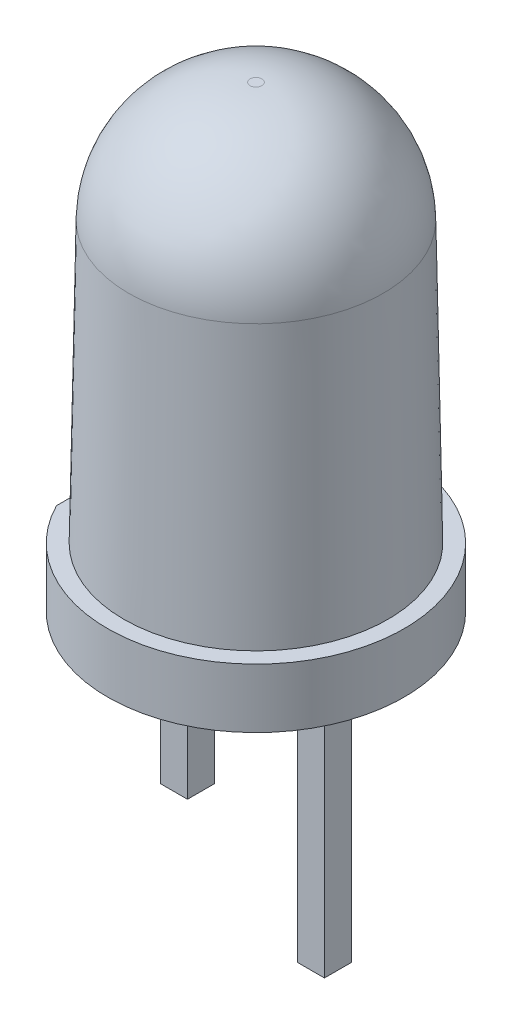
ISO-10303-21;
HEADER;
FILE_DESCRIPTION(('STEP AP214'),'2;1');
FILE_NAME('part.step','',(''),(''),'','','');
FILE_SCHEMA(('AUTOMOTIVE_DESIGN { 1 0 10303 214 1 1 1 1 }'));
ENDSEC;
DATA;
#1=APPLICATION_CONTEXT('core data for automotive mechanical design processes');
#2=APPLICATION_PROTOCOL_DEFINITION('international standard','automotive_design',2000,#1);
#3=PRODUCT_CONTEXT('',#1,'mechanical');
#4=PRODUCT('Part','Part','',(#3));
#5=PRODUCT_RELATED_PRODUCT_CATEGORY('part','',(#4));
#6=PRODUCT_DEFINITION_FORMATION('','',#4);
#7=PRODUCT_DEFINITION_CONTEXT('part definition',#1,'design');
#8=PRODUCT_DEFINITION('design','',#6,#7);
#9=PRODUCT_DEFINITION_SHAPE('','',#8);
#10=(LENGTH_UNIT() NAMED_UNIT(*) SI_UNIT(.MILLI.,.METRE.));
#11=(NAMED_UNIT(*) PLANE_ANGLE_UNIT() SI_UNIT($,.RADIAN.));
#12=(NAMED_UNIT(*) SI_UNIT($,.STERADIAN.) SOLID_ANGLE_UNIT());
#13=UNCERTAINTY_MEASURE_WITH_UNIT(LENGTH_MEASURE(1.E-05),#10,'distance_accuracy_value','');
#14=(GEOMETRIC_REPRESENTATION_CONTEXT(3) GLOBAL_UNCERTAINTY_ASSIGNED_CONTEXT((#13)) GLOBAL_UNIT_ASSIGNED_CONTEXT((#10,
#11,#12)) REPRESENTATION_CONTEXT('',''));
#15=CARTESIAN_POINT('',(0.,0.,0.));
#16=DIRECTION('',(0.,0.,1.));
#17=DIRECTION('',(1.,0.,0.));
#18=AXIS2_PLACEMENT_3D('',#15,#16,#17);
#19=CARTESIAN_POINT('',(0.,0.,0.));
#20=DIRECTION('',(0.,1.,0.));
#21=DIRECTION('',(0.,0.,1.));
#22=AXIS2_PLACEMENT_3D('',#19,#20,#21);
#23=PLANE('',#22);
#24=DIRECTION('',(0.,0.,1.));
#25=VECTOR('',#24,1.);
#26=CARTESIAN_POINT('',(-1.02,0.,0.25));
#27=LINE('',#26,#25);
#28=CARTESIAN_POINT('',(-1.02,0.,-0.25));
#29=VERTEX_POINT('',#28);
#30=CARTESIAN_POINT('',(-1.02,0.,0.25));
#31=VERTEX_POINT('',#30);
#32=EDGE_CURVE('E95',#29,#31,#27,.T.);
#33=ORIENTED_EDGE('',*,*,#32,.F.);
#34=DIRECTION('',(1.,0.,0.));
#35=VECTOR('',#34,1.);
#36=CARTESIAN_POINT('',(-1.52,0.,-0.25));
#37=LINE('',#36,#35);
#38=CARTESIAN_POINT('',(-1.52,0.,-0.25));
#39=VERTEX_POINT('',#38);
#40=EDGE_CURVE('E162',#39,#29,#37,.T.);
#41=ORIENTED_EDGE('',*,*,#40,.F.);
#42=DIRECTION('',(0.,0.,-1.));
#43=VECTOR('',#42,1.);
#44=CARTESIAN_POINT('',(-1.52,0.,0.25));
#45=LINE('',#44,#43);
#46=CARTESIAN_POINT('',(-1.52,0.,0.25));
#47=VERTEX_POINT('',#46);
#48=EDGE_CURVE('E159',#47,#39,#45,.T.);
#49=ORIENTED_EDGE('',*,*,#48,.F.);
#50=DIRECTION('',(-1.,0.,0.));
#51=VECTOR('',#50,1.);
#52=CARTESIAN_POINT('',(-1.52,0.,0.25));
#53=LINE('',#52,#51);
#54=EDGE_CURVE('E156',#31,#47,#53,.T.);
#55=ORIENTED_EDGE('',*,*,#54,.F.);
#56=EDGE_LOOP('',(#33,#41,#49,#55));
#57=FACE_BOUND('',#56,.T.);
#58=CARTESIAN_POINT('',(0.,0.,0.));
#59=DIRECTION('',(0.,1.,0.));
#60=DIRECTION('',(0.,0.,1.));
#61=AXIS2_PLACEMENT_3D('',#58,#59,#60);
#62=CIRCLE('',#61,2.75);
#63=CARTESIAN_POINT('',(-2.45,0.,1.24899959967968));
#64=VERTEX_POINT('',#63);
#65=CARTESIAN_POINT('',(-2.45,0.,-1.24899959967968));
#66=VERTEX_POINT('',#65);
#67=EDGE_CURVE('E187',#64,#66,#62,.T.);
#68=ORIENTED_EDGE('',*,*,#67,.F.);
#69=DIRECTION('',(0.,0.,-1.));
#70=VECTOR('',#69,1.);
#71=CARTESIAN_POINT('',(-2.45,0.,-1.24899959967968));
#72=LINE('',#71,#70);
#73=EDGE_CURVE('E178',#64,#66,#72,.T.);
#74=ORIENTED_EDGE('',*,*,#73,.T.);
#75=EDGE_LOOP('',(#68,#74));
#76=FACE_BOUND('',#75,.T.);
#77=DIRECTION('',(0.,0.,1.));
#78=VECTOR('',#77,1.);
#79=CARTESIAN_POINT('',(1.52,0.,0.25));
#80=LINE('',#79,#78);
#81=CARTESIAN_POINT('',(1.52,0.,-0.25));
#82=VERTEX_POINT('',#81);
#83=CARTESIAN_POINT('',(1.52,0.,0.25));
#84=VERTEX_POINT('',#83);
#85=EDGE_CURVE('E129',#82,#84,#80,.T.);
#86=ORIENTED_EDGE('',*,*,#85,.F.);
#87=DIRECTION('',(1.,0.,0.));
#88=VECTOR('',#87,1.);
#89=CARTESIAN_POINT('',(1.02,0.,-0.25));
#90=LINE('',#89,#88);
#91=CARTESIAN_POINT('',(1.02,0.,-0.25));
#92=VERTEX_POINT('',#91);
#93=EDGE_CURVE('E125',#92,#82,#90,.T.);
#94=ORIENTED_EDGE('',*,*,#93,.F.);
#95=DIRECTION('',(0.,0.,-1.));
#96=VECTOR('',#95,1.);
#97=CARTESIAN_POINT('',(1.02,0.,0.25));
#98=LINE('',#97,#96);
#99=CARTESIAN_POINT('',(1.02,0.,0.25));
#100=VERTEX_POINT('',#99);
#101=EDGE_CURVE('E127',#100,#92,#98,.T.);
#102=ORIENTED_EDGE('',*,*,#101,.F.);
#103=DIRECTION('',(-1.,0.,0.));
#104=VECTOR('',#103,1.);
#105=CARTESIAN_POINT('',(1.02,0.,0.25));
#106=LINE('',#105,#104);
#107=EDGE_CURVE('E67',#84,#100,#106,.T.);
#108=ORIENTED_EDGE('',*,*,#107,.F.);
#109=EDGE_LOOP('',(#86,#94,#102,#108));
#110=FACE_BOUND('',#109,.T.);
#111=ADVANCED_FACE('F48',(#57,#76,#110),#23,.F.);
#112=CARTESIAN_POINT('',(0.,1.1,0.));
#113=DIRECTION('',(0.,-1.,0.));
#114=DIRECTION('',(0.,0.,-1.));
#115=AXIS2_PLACEMENT_3D('',#112,#113,#114);
#116=CYLINDRICAL_SURFACE('',#115,2.75);
#117=CARTESIAN_POINT('',(0.,1.1,0.));
#118=DIRECTION('',(0.,1.,0.));
#119=DIRECTION('',(0.,0.,1.));
#120=AXIS2_PLACEMENT_3D('',#117,#118,#119);
#121=CIRCLE('',#120,2.75);
#122=CARTESIAN_POINT('',(-2.45,1.1,1.24899959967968));
#123=VERTEX_POINT('',#122);
#124=CARTESIAN_POINT('',(-2.45,1.1,-1.24899959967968));
#125=VERTEX_POINT('',#124);
#126=EDGE_CURVE('E192',#123,#125,#121,.T.);
#127=ORIENTED_EDGE('',*,*,#126,.F.);
#128=DIRECTION('',(0.,1.,0.));
#129=VECTOR('',#128,1.);
#130=CARTESIAN_POINT('',(-2.45,0.,1.24899959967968));
#131=LINE('',#130,#129);
#132=EDGE_CURVE('E181',#64,#123,#131,.T.);
#133=ORIENTED_EDGE('',*,*,#132,.F.);
#134=ORIENTED_EDGE('',*,*,#67,.T.);
#135=DIRECTION('',(0.,1.,0.));
#136=VECTOR('',#135,1.);
#137=CARTESIAN_POINT('',(-2.45,0.,-1.24899959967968));
#138=LINE('',#137,#136);
#139=EDGE_CURVE('E184',#66,#125,#138,.T.);
#140=ORIENTED_EDGE('',*,*,#139,.T.);
#141=EDGE_LOOP('',(#127,#133,#134,#140));
#142=FACE_BOUND('',#141,.T.);
#143=ADVANCED_FACE('F216',(#142),#116,.T.);
#144=CARTESIAN_POINT('',(0.,1.1,0.));
#145=DIRECTION('',(0.,1.,0.));
#146=DIRECTION('',(0.,0.,1.));
#147=AXIS2_PLACEMENT_3D('',#144,#145,#146);
#148=PLANE('',#147);
#149=DIRECTION('',(0.,0.,-1.));
#150=VECTOR('',#149,1.);
#151=CARTESIAN_POINT('',(-2.45,1.1,-1.24899959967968));
#152=LINE('',#151,#150);
#153=CARTESIAN_POINT('',(-2.45,1.1,0.));
#154=VERTEX_POINT('',#153);
#155=EDGE_CURVE('E182',#123,#154,#152,.T.);
#156=ORIENTED_EDGE('',*,*,#155,.F.);
#157=ORIENTED_EDGE('',*,*,#126,.T.);
#158=EDGE_CURVE('E177',#154,#125,#152,.T.);
#159=ORIENTED_EDGE('',*,*,#158,.F.);
#160=CARTESIAN_POINT('',(0.,1.1,0.));
#161=DIRECTION('',(0.,1.,0.));
#162=DIRECTION('',(0.,0.,1.));
#163=AXIS2_PLACEMENT_3D('',#160,#161,#162);
#164=CIRCLE('',#163,2.45);
#165=EDGE_CURVE('E189',#154,#154,#164,.T.);
#166=ORIENTED_EDGE('',*,*,#165,.F.);
#167=EDGE_LOOP('',(#156,#157,#159,#166));
#168=FACE_BOUND('',#167,.T.);
#169=ADVANCED_FACE('F228',(#168),#148,.T.);
#170=CARTESIAN_POINT('',(0.,8.5,0.));
#171=DIRECTION('',(0.,1.,0.));
#172=DIRECTION('',(0.,0.,1.));
#173=AXIS2_PLACEMENT_3D('',#170,#171,#172);
#174=PLANE('',#173);
#175=CARTESIAN_POINT('',(0.,8.5,0.));
#176=DIRECTION('',(0.,1.,0.));
#177=DIRECTION('',(0.,0.,1.));
#178=AXIS2_PLACEMENT_3D('',#175,#176,#177);
#179=CIRCLE('',#178,0.109763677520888);
#180=CARTESIAN_POINT('',(0.,8.5,0.109763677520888));
#181=VERTEX_POINT('',#180);
#182=EDGE_CURVE('E58',#181,#181,#179,.T.);
#183=ORIENTED_EDGE('',*,*,#182,.T.);
#184=EDGE_LOOP('',(#183));
#185=FACE_BOUND('',#184,.T.);
#186=ADVANCED_FACE('F233',(#185),#174,.T.);
#187=CARTESIAN_POINT('',(0.,1.1,0.));
#188=DIRECTION('',(0.,-1.,0.));
#189=DIRECTION('',(0.,0.,1.));
#190=AXIS2_PLACEMENT_3D('',#187,#188,#189);
#191=CONICAL_SURFACE('',#190,2.45,0.0174532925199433);
#192=CARTESIAN_POINT('',(0.,6.28926791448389,0.));
#193=DIRECTION('',(0.,1.,0.));
#194=DIRECTION('',(0.,0.,1.));
#195=AXIS2_PLACEMENT_3D('',#192,#193,#194);
#196=CIRCLE('',#195,2.35942099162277);
#197=CARTESIAN_POINT('',(0.,6.28926791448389,2.35942099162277));
#198=VERTEX_POINT('',#197);
#199=EDGE_CURVE('E13',#198,#198,#196,.F.);
#200=ORIENTED_EDGE('',*,*,#199,.T.);
#201=EDGE_LOOP('',(#200));
#202=FACE_BOUND('',#201,.T.);
#203=ORIENTED_EDGE('',*,*,#165,.T.);
#204=EDGE_LOOP('',(#203));
#205=FACE_BOUND('',#204,.T.);
#206=ADVANCED_FACE('F230',(#202,#205),#191,.T.);
#207=CARTESIAN_POINT('',(0.,6.25,0.));
#208=DIRECTION('',(0.,1.,0.));
#209=DIRECTION('',(0.,0.,1.));
#210=AXIS2_PLACEMENT_3D('',#207,#208,#209);
#211=DEGENERATE_TOROIDAL_SURFACE('',#210,0.109763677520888,2.25,.T.);
#212=ORIENTED_EDGE('',*,*,#199,.F.);
#213=EDGE_LOOP('',(#212));
#214=FACE_BOUND('',#213,.T.);
#215=ORIENTED_EDGE('',*,*,#182,.F.);
#216=EDGE_LOOP('',(#215));
#217=FACE_BOUND('',#216,.T.);
#218=ADVANCED_FACE('F232',(#214,#217),#211,.T.);
#219=CARTESIAN_POINT('',(-2.45,0.,-1.24899959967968));
#220=DIRECTION('',(1.,0.,0.));
#221=DIRECTION('',(0.,0.,-1.));
#222=AXIS2_PLACEMENT_3D('',#219,#220,#221);
#223=PLANE('',#222);
#224=ORIENTED_EDGE('',*,*,#155,.T.);
#225=ORIENTED_EDGE('',*,*,#158,.T.);
#226=ORIENTED_EDGE('',*,*,#139,.F.);
#227=ORIENTED_EDGE('',*,*,#73,.F.);
#228=ORIENTED_EDGE('',*,*,#132,.T.);
#229=EDGE_LOOP('',(#224,#225,#226,#227,#228));
#230=FACE_BOUND('',#229,.T.);
#231=ADVANCED_FACE('F224',(#230),#223,.F.);
#232=CARTESIAN_POINT('',(-1.02,-5.,0.25));
#233=DIRECTION('',(-1.,0.,0.));
#234=DIRECTION('',(0.,0.,1.));
#235=AXIS2_PLACEMENT_3D('',#232,#233,#234);
#236=PLANE('',#235);
#237=ORIENTED_EDGE('',*,*,#32,.T.);
#238=DIRECTION('',(0.,1.,0.));
#239=VECTOR('',#238,1.);
#240=CARTESIAN_POINT('',(-1.02,-5.,0.25));
#241=LINE('',#240,#239);
#242=CARTESIAN_POINT('',(-1.02,-3.4,0.25));
#243=VERTEX_POINT('',#242);
#244=EDGE_CURVE('E175',#243,#31,#241,.T.);
#245=ORIENTED_EDGE('',*,*,#244,.F.);
#246=DIRECTION('',(0.,0.,1.));
#247=VECTOR('',#246,1.);
#248=CARTESIAN_POINT('',(-1.02,-3.4,0.25));
#249=LINE('',#248,#247);
#250=CARTESIAN_POINT('',(-1.02,-3.4,-0.25));
#251=VERTEX_POINT('',#250);
#252=EDGE_CURVE('E164',#251,#243,#249,.T.);
#253=ORIENTED_EDGE('',*,*,#252,.F.);
#254=DIRECTION('',(0.,1.,0.));
#255=VECTOR('',#254,1.);
#256=CARTESIAN_POINT('',(-1.02,-5.,-0.25));
#257=LINE('',#256,#255);
#258=EDGE_CURVE('E165',#251,#29,#257,.T.);
#259=ORIENTED_EDGE('',*,*,#258,.T.);
#260=EDGE_LOOP('',(#237,#245,#253,#259));
#261=FACE_BOUND('',#260,.T.);
#262=ADVANCED_FACE('F212',(#261),#236,.F.);
#263=CARTESIAN_POINT('',(-1.52,-5.,0.25));
#264=DIRECTION('',(0.,0.,-1.));
#265=DIRECTION('',(-1.,0.,0.));
#266=AXIS2_PLACEMENT_3D('',#263,#264,#265);
#267=PLANE('',#266);
#268=ORIENTED_EDGE('',*,*,#54,.T.);
#269=DIRECTION('',(0.,1.,0.));
#270=VECTOR('',#269,1.);
#271=CARTESIAN_POINT('',(-1.52,-5.,0.25));
#272=LINE('',#271,#270);
#273=CARTESIAN_POINT('',(-1.52,-3.4,0.25));
#274=VERTEX_POINT('',#273);
#275=EDGE_CURVE('E172',#274,#47,#272,.T.);
#276=ORIENTED_EDGE('',*,*,#275,.F.);
#277=DIRECTION('',(-1.,0.,0.));
#278=VECTOR('',#277,1.);
#279=CARTESIAN_POINT('',(-1.52,-3.4,0.25));
#280=LINE('',#279,#278);
#281=EDGE_CURVE('E52',#243,#274,#280,.T.);
#282=ORIENTED_EDGE('',*,*,#281,.F.);
#283=ORIENTED_EDGE('',*,*,#244,.T.);
#284=EDGE_LOOP('',(#268,#276,#282,#283));
#285=FACE_BOUND('',#284,.T.);
#286=ADVANCED_FACE('F213',(#285),#267,.F.);
#287=CARTESIAN_POINT('',(-1.52,-5.,0.25));
#288=DIRECTION('',(1.,0.,0.));
#289=DIRECTION('',(0.,0.,-1.));
#290=AXIS2_PLACEMENT_3D('',#287,#288,#289);
#291=PLANE('',#290);
#292=ORIENTED_EDGE('',*,*,#48,.T.);
#293=DIRECTION('',(0.,1.,0.));
#294=VECTOR('',#293,1.);
#295=CARTESIAN_POINT('',(-1.52,-5.,-0.25));
#296=LINE('',#295,#294);
#297=CARTESIAN_POINT('',(-1.52,-3.4,-0.25));
#298=VERTEX_POINT('',#297);
#299=EDGE_CURVE('E168',#298,#39,#296,.T.);
#300=ORIENTED_EDGE('',*,*,#299,.F.);
#301=DIRECTION('',(0.,0.,-1.));
#302=VECTOR('',#301,1.);
#303=CARTESIAN_POINT('',(-1.52,-3.4,0.25));
#304=LINE('',#303,#302);
#305=EDGE_CURVE('E200',#274,#298,#304,.T.);
#306=ORIENTED_EDGE('',*,*,#305,.F.);
#307=ORIENTED_EDGE('',*,*,#275,.T.);
#308=EDGE_LOOP('',(#292,#300,#306,#307));
#309=FACE_BOUND('',#308,.T.);
#310=ADVANCED_FACE('F206',(#309),#291,.F.);
#311=CARTESIAN_POINT('',(-1.52,-5.,-0.25));
#312=DIRECTION('',(0.,0.,1.));
#313=DIRECTION('',(1.,0.,0.));
#314=AXIS2_PLACEMENT_3D('',#311,#312,#313);
#315=PLANE('',#314);
#316=ORIENTED_EDGE('',*,*,#40,.T.);
#317=ORIENTED_EDGE('',*,*,#258,.F.);
#318=DIRECTION('',(1.,0.,0.));
#319=VECTOR('',#318,1.);
#320=CARTESIAN_POINT('',(-1.52,-3.4,-0.25));
#321=LINE('',#320,#319);
#322=EDGE_CURVE('E169',#298,#251,#321,.T.);
#323=ORIENTED_EDGE('',*,*,#322,.F.);
#324=ORIENTED_EDGE('',*,*,#299,.T.);
#325=EDGE_LOOP('',(#316,#317,#323,#324));
#326=FACE_BOUND('',#325,.T.);
#327=ADVANCED_FACE('F208',(#326),#315,.F.);
#328=CARTESIAN_POINT('',(0.,-3.4,0.));
#329=DIRECTION('',(0.,-1.,0.));
#330=DIRECTION('',(0.,0.,-1.));
#331=AXIS2_PLACEMENT_3D('',#328,#329,#330);
#332=PLANE('',#331);
#333=ORIENTED_EDGE('',*,*,#252,.T.);
#334=ORIENTED_EDGE('',*,*,#281,.T.);
#335=ORIENTED_EDGE('',*,*,#305,.T.);
#336=ORIENTED_EDGE('',*,*,#322,.T.);
#337=EDGE_LOOP('',(#333,#334,#335,#336));
#338=FACE_BOUND('',#337,.T.);
#339=ADVANCED_FACE('F50',(#338),#332,.T.);
#340=CARTESIAN_POINT('',(1.52,-5.,0.25));
#341=DIRECTION('',(-1.,0.,0.));
#342=DIRECTION('',(0.,0.,1.));
#343=AXIS2_PLACEMENT_3D('',#340,#341,#342);
#344=PLANE('',#343);
#345=ORIENTED_EDGE('',*,*,#85,.T.);
#346=DIRECTION('',(0.,1.,0.));
#347=VECTOR('',#346,1.);
#348=CARTESIAN_POINT('',(1.52,-5.,0.25));
#349=LINE('',#348,#347);
#350=CARTESIAN_POINT('',(1.52,-5.,0.25));
#351=VERTEX_POINT('',#350);
#352=EDGE_CURVE('E150',#351,#84,#349,.T.);
#353=ORIENTED_EDGE('',*,*,#352,.F.);
#354=DIRECTION('',(0.,0.,1.));
#355=VECTOR('',#354,1.);
#356=CARTESIAN_POINT('',(1.52,-5.,0.25));
#357=LINE('',#356,#355);
#358=CARTESIAN_POINT('',(1.52,-5.,-0.25));
#359=VERTEX_POINT('',#358);
#360=EDGE_CURVE('E134',#359,#351,#357,.T.);
#361=ORIENTED_EDGE('',*,*,#360,.F.);
#362=DIRECTION('',(0.,1.,0.));
#363=VECTOR('',#362,1.);
#364=CARTESIAN_POINT('',(1.52,-5.,-0.25));
#365=LINE('',#364,#363);
#366=EDGE_CURVE('E148',#359,#82,#365,.T.);
#367=ORIENTED_EDGE('',*,*,#366,.T.);
#368=EDGE_LOOP('',(#345,#353,#361,#367));
#369=FACE_BOUND('',#368,.T.);
#370=ADVANCED_FACE('F260',(#369),#344,.F.);
#371=CARTESIAN_POINT('',(1.02,-5.,0.25));
#372=DIRECTION('',(0.,0.,-1.));
#373=DIRECTION('',(-1.,0.,0.));
#374=AXIS2_PLACEMENT_3D('',#371,#372,#373);
#375=PLANE('',#374);
#376=ORIENTED_EDGE('',*,*,#107,.T.);
#377=DIRECTION('',(0.,1.,0.));
#378=VECTOR('',#377,1.);
#379=CARTESIAN_POINT('',(1.02,-5.,0.25));
#380=LINE('',#379,#378);
#381=CARTESIAN_POINT('',(1.02,-5.,0.25));
#382=VERTEX_POINT('',#381);
#383=EDGE_CURVE('E144',#382,#100,#380,.T.);
#384=ORIENTED_EDGE('',*,*,#383,.F.);
#385=DIRECTION('',(-1.,0.,0.));
#386=VECTOR('',#385,1.);
#387=CARTESIAN_POINT('',(1.02,-5.,0.25));
#388=LINE('',#387,#386);
#389=EDGE_CURVE('E285',#351,#382,#388,.T.);
#390=ORIENTED_EDGE('',*,*,#389,.F.);
#391=ORIENTED_EDGE('',*,*,#352,.T.);
#392=EDGE_LOOP('',(#376,#384,#390,#391));
#393=FACE_BOUND('',#392,.T.);
#394=ADVANCED_FACE('F263',(#393),#375,.F.);
#395=CARTESIAN_POINT('',(1.02,-5.,0.25));
#396=DIRECTION('',(1.,0.,0.));
#397=DIRECTION('',(0.,0.,-1.));
#398=AXIS2_PLACEMENT_3D('',#395,#396,#397);
#399=PLANE('',#398);
#400=ORIENTED_EDGE('',*,*,#101,.T.);
#401=DIRECTION('',(0.,1.,0.));
#402=VECTOR('',#401,1.);
#403=CARTESIAN_POINT('',(1.02,-5.,-0.25));
#404=LINE('',#403,#402);
#405=CARTESIAN_POINT('',(1.02,-5.,-0.25));
#406=VERTEX_POINT('',#405);
#407=EDGE_CURVE('E141',#406,#92,#404,.T.);
#408=ORIENTED_EDGE('',*,*,#407,.F.);
#409=DIRECTION('',(0.,0.,-1.));
#410=VECTOR('',#409,1.);
#411=CARTESIAN_POINT('',(1.02,-5.,0.25));
#412=LINE('',#411,#410);
#413=EDGE_CURVE('E288',#382,#406,#412,.T.);
#414=ORIENTED_EDGE('',*,*,#413,.F.);
#415=ORIENTED_EDGE('',*,*,#383,.T.);
#416=EDGE_LOOP('',(#400,#408,#414,#415));
#417=FACE_BOUND('',#416,.T.);
#418=ADVANCED_FACE('F139',(#417),#399,.F.);
#419=CARTESIAN_POINT('',(1.02,-5.,-0.25));
#420=DIRECTION('',(0.,0.,1.));
#421=DIRECTION('',(1.,0.,0.));
#422=AXIS2_PLACEMENT_3D('',#419,#420,#421);
#423=PLANE('',#422);
#424=ORIENTED_EDGE('',*,*,#93,.T.);
#425=ORIENTED_EDGE('',*,*,#366,.F.);
#426=DIRECTION('',(1.,0.,0.));
#427=VECTOR('',#426,1.);
#428=CARTESIAN_POINT('',(1.02,-5.,-0.25));
#429=LINE('',#428,#427);
#430=EDGE_CURVE('E147',#406,#359,#429,.T.);
#431=ORIENTED_EDGE('',*,*,#430,.F.);
#432=ORIENTED_EDGE('',*,*,#407,.T.);
#433=EDGE_LOOP('',(#424,#425,#431,#432));
#434=FACE_BOUND('',#433,.T.);
#435=ADVANCED_FACE('F146',(#434),#423,.F.);
#436=CARTESIAN_POINT('',(0.,-5.,0.));
#437=DIRECTION('',(0.,-1.,0.));
#438=DIRECTION('',(0.,0.,-1.));
#439=AXIS2_PLACEMENT_3D('',#436,#437,#438);
#440=PLANE('',#439);
#441=ORIENTED_EDGE('',*,*,#360,.T.);
#442=ORIENTED_EDGE('',*,*,#389,.T.);
#443=ORIENTED_EDGE('',*,*,#413,.T.);
#444=ORIENTED_EDGE('',*,*,#430,.T.);
#445=EDGE_LOOP('',(#441,#442,#443,#444));
#446=FACE_BOUND('',#445,.T.);
#447=ADVANCED_FACE('F272',(#446),#440,.T.);
#448=CLOSED_SHELL('',(#111,#143,#169,#186,#206,#218,#231,#262,#286,#310,#327,#339,#370,#394,
#418,#435,#447));
#449=MANIFOLD_SOLID_BREP('B2',#448);
#450=ADVANCED_BREP_SHAPE_REPRESENTATION('',(#18,#449),#14);
#451=SHAPE_DEFINITION_REPRESENTATION(#9,#450);
ENDSEC;
END-ISO-10303-21;
